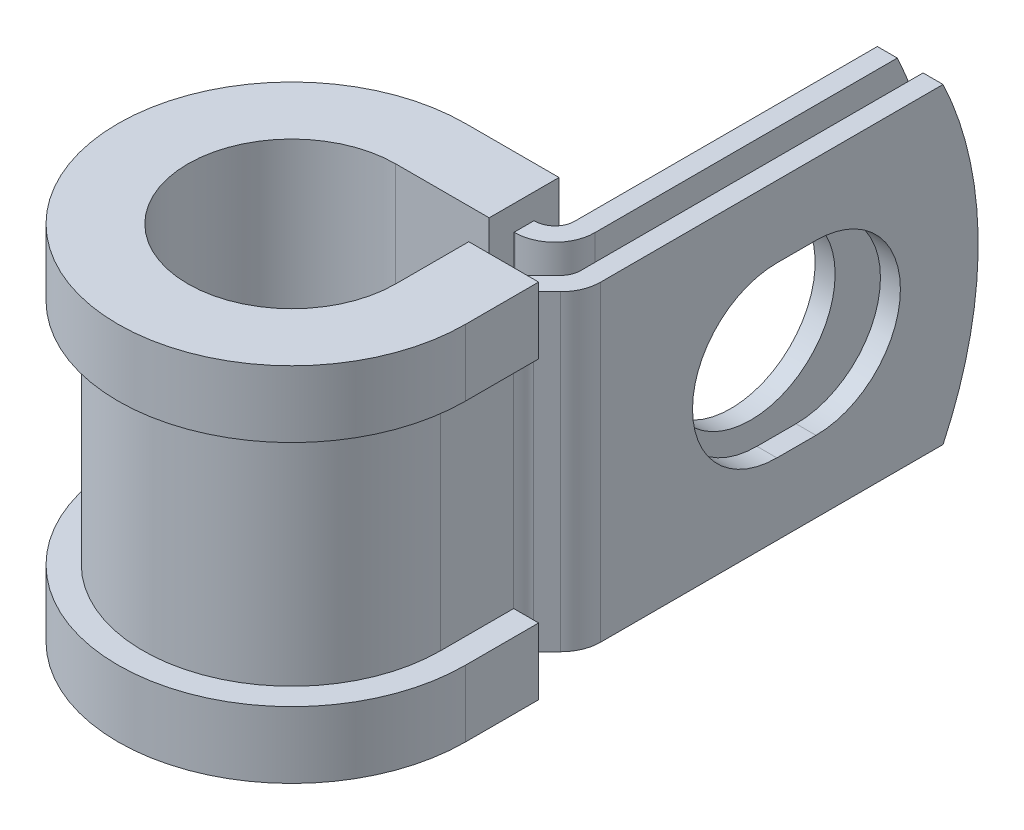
from build123d import *

# Parameters (mm, degrees)
EXTRUDE_THIN1_DEPTH = 9.525
SKETCH2_R           = 5.1562
CUT_EXTRUDE1_DEPTH  = 1.2192
CUT_EXTRUDE2_DEPTH  = 1.2192
CUT_EXTRUDE3_DEPTH  = 37.140038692


with BuildPart() as part:
    # Sketch1 → Extrude-Thin1 (new, symmetric)
    with BuildSketch(Plane(origin=(0, 0, 0), x_dir=(1, 0, 0), z_dir=(0, 1, 0))):
        with BuildLine():
            Line((9.7714698, 30.9372), (9.7714698, 7.874))
            ThreePointArc((9.7714698, 7.874), (9.678663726, 7.407432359), (9.414374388, 7.011895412))
            Line((9.414374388, 7.011895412), (8.588190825, 6.185711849))
            ThreePointArc((8.588190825, 6.185711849), (8.059612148, 5.394637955), (7.874, 4.461502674))
            Line((7.874, 4.461502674), (7.874, 0))
            ThreePointArc((7.874, 0), (-5.567758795, -5.567758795), (0, 7.874))
            Line((0, 7.874), (5.7582698, 7.874))
            ThreePointArc((5.7582698, 7.874), (7.482478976, 8.588190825), (8.1966698, 10.3124))
            Line((8.1966698, 10.3124), (8.1966698, 30.9372))
            Line((8.1966698, 30.9372), (6.9774698, 30.9372))
            Line((6.9774698, 30.9372), (6.9774698, 10.3124))
            ThreePointArc((6.9774698, 10.3124), (6.620374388, 9.450295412), (5.7582698, 9.0932))
            Line((5.7582698, 9.0932), (0, 9.0932))
            ThreePointArc((0, 9.0932), (-6.429863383, -6.429863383), (9.0932, 0))
            Line((9.0932, 0), (9.0932, 4.461502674))
            ThreePointArc((9.0932, 4.461502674), (9.186006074, 4.928070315), (9.450295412, 5.323607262))
            Line((9.450295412, 5.323607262), (10.276478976, 6.149790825))
            ThreePointArc((10.276478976, 6.149790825), (10.805057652, 6.940864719), (10.9906698, 7.874))
            Line((10.9906698, 7.874), (10.9906698, 30.9372))
            Line((10.9906698, 30.9372), (9.7714698, 30.9372))
        make_face()
    extrude(amount=EXTRUDE_THIN1_DEPTH, both=True)

    # Sketch2 → Cut-Extrude1 (cut)
    with BuildSketch(Plane.ZY.offset(-6.9774698)):
        with Locations((-19.8374, 0)):
            Circle(SKETCH2_R)
    extrude(amount=-CUT_EXTRUDE1_DEPTH, mode=Mode.SUBTRACT)

    # Sketch3 → Cut-Extrude2 (cut)
    with BuildSketch(Plane(origin=(10.9906698, 0, 0), x_dir=(0, 0, -1), z_dir=(1, 0, 0))):
        with BuildLine():
            Line((18.6436, 5.1562), (21.0312, 5.1562))
            ThreePointArc((21.0312, 5.1562), (26.1874, 0), (21.0312, -5.1562))
            Line((21.0312, -5.1562), (18.6436, -5.1562))
            ThreePointArc((18.6436, -5.1562), (13.4874, 0), (18.6436, 5.1562))
        make_face()
    extrude(amount=-CUT_EXTRUDE2_DEPTH, mode=Mode.SUBTRACT)

    # Sketch4 → Cut-Extrude3 (cut, through all)
    with BuildSketch(Plane.ZY.offset(-6.9774698)):
        with BuildLine():
            Line((-28.792663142, 9.525), (-30.9372, 9.525))
            Line((-30.9372, 9.525), (-30.9372, 1.67e-07))
            ThreePointArc((-30.9372, 1.67e-07), (-30.394438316, 4.88171759), (-28.792663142, 9.525))
        make_face()
        with BuildLine():
            ThreePointArc((-28.792663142, -9.525), (-30.394438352, -4.881717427), (-30.9372, 1.67e-07))
            Line((-30.9372, 1.67e-07), (-30.9372, -9.525))
            Line((-30.9372, -9.525), (-28.792663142, -9.525))
        make_face()
    extrude(amount=-CUT_EXTRUDE3_DEPTH, mode=Mode.SUBTRACT)

    # Sweep1: sweep along a path in Sketch6
    with BuildLine(Plane(origin=(0, 9.525, 0), x_dir=(1, 0, 0), z_dir=(0, 1, 0))) as sweep1_path:
        Line((6.35, 4.461502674), (6.35, 0))
        ThreePointArc((6.35, 0), (-4.490128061, -4.490128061), (0, 6.35))
        Line((0, 6.35), (5.7074698, 6.35))
    # Sketch5 → Sweep1 (sweep)
    with BuildSketch(Plane(origin=(0, 0, -4.461502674), x_dir=(-1, 0, 0), z_dir=(0, 0, -1))):
        Polygon((-9.0932, 9.525), (-7.874, 9.525), (-7.874, -9.525), (-9.0932, -9.525), (-9.0932, -6.985), (-10.6172, -6.985), (-10.6172, -11.049), (-6.35, -11.049), (-6.35, 11.049), (-10.6172, 11.049), (-10.6172, 6.985), (-9.0932, 6.985), align=None)
    sweep(path=sweep1_path.line)


solid = part.part
